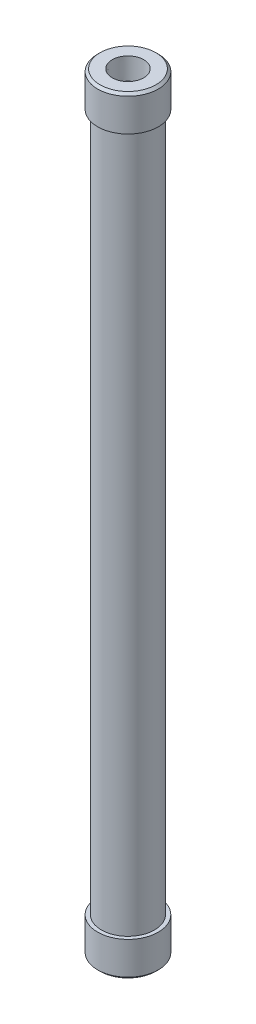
from build123d import *

# Parameters (mm, degrees)
SKETCH1_R           = 16.7005
SKETCH1_R_2         = 13.1445
BOSS_EXTRUDE1_DEPTH = 482.6
SKETCH2_R           = 19.05
BOSS_EXTRUDE2_DEPTH = 22.098
BOSS_EXTRUDE3_START = -22.098
SKETCH3_R           = 19.05
BOSS_EXTRUDE3_DEPTH = 22.098
CHAMFER2_SIZE       = 1.524


with BuildPart() as part:
    # Sketch1 → Boss-Extrude1 (new body)
    with BuildSketch(Plane(origin=(0, 0, 0), x_dir=(1, 0, 0), z_dir=(0, 1, 0))):
        with Locations(Location((0, 0, 0), (0, 0, 90))):
            Circle(SKETCH1_R)
        with Locations(Location((0, 0, 0), (0, 0, 90))):
            Circle(SKETCH1_R_2, mode=Mode.SUBTRACT)
    extrude(amount=BOSS_EXTRUDE1_DEPTH)

    # Sketch2 → Boss-Extrude2 (add)
    with BuildSketch(Plane(origin=(0, 0, 0), x_dir=(1, 0, 0), z_dir=(0, 1, 0))):
        with Locations(Location((0, 0, 0), (0, 0, 270))):
            Circle(SKETCH2_R)
    extrude(amount=BOSS_EXTRUDE2_DEPTH)

    # Sketch3 → Boss-Extrude3 (add)
    with BuildSketch(Plane(origin=(0, 482.6, 0), x_dir=(1, 0, 0), z_dir=(0, 1, 0)).offset(BOSS_EXTRUDE3_START)):
        with Locations(Location((0, 0, 0), (0, 0, 270))):
            Circle(SKETCH3_R)
    extrude(amount=BOSS_EXTRUDE3_DEPTH)

    # Sketch5 → 1_2 NPT Tapped Hole1 (revolve, cut)
    with BuildSketch(Plane(origin=(0, 0, 0), x_dir=(0, 0, -1), z_dir=(1, 0, 0))):
        Polygon((0, 0), (0, 27.970543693), (8.9281, 22.606), (8.9281, 13.462), (9.479726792, 13.462), (9.8827971, 0), align=None)
    revolve(axis=Axis((0, -6.35, 0), (0, 1, 0)), mode=Mode.SUBTRACT)

    # Sketch7 → 1_2 NPT Tapped Hole2 (revolve, cut)
    with BuildSketch(Plane(origin=(0, 482.6, 0), x_dir=(0, 0, 1), z_dir=(1, 0, 0))):
        Polygon((0, 0), (0, 27.970543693), (8.9281, 22.606), (8.9281, 13.462), (9.479726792, 13.462), (9.8827971, 0), align=None)
    revolve(axis=Axis((0, 488.95, 0), (0, -1, 0)), mode=Mode.SUBTRACT)

    # Chamfer2
    chamfer2_edges = [part.edges().sort_by_distance(p)[0] for p in [
        (0, 0, -19.05),
        (0, 482.6, -19.05),
    ]]
    chamfer(chamfer2_edges, length=CHAMFER2_SIZE)


solid = part.part
